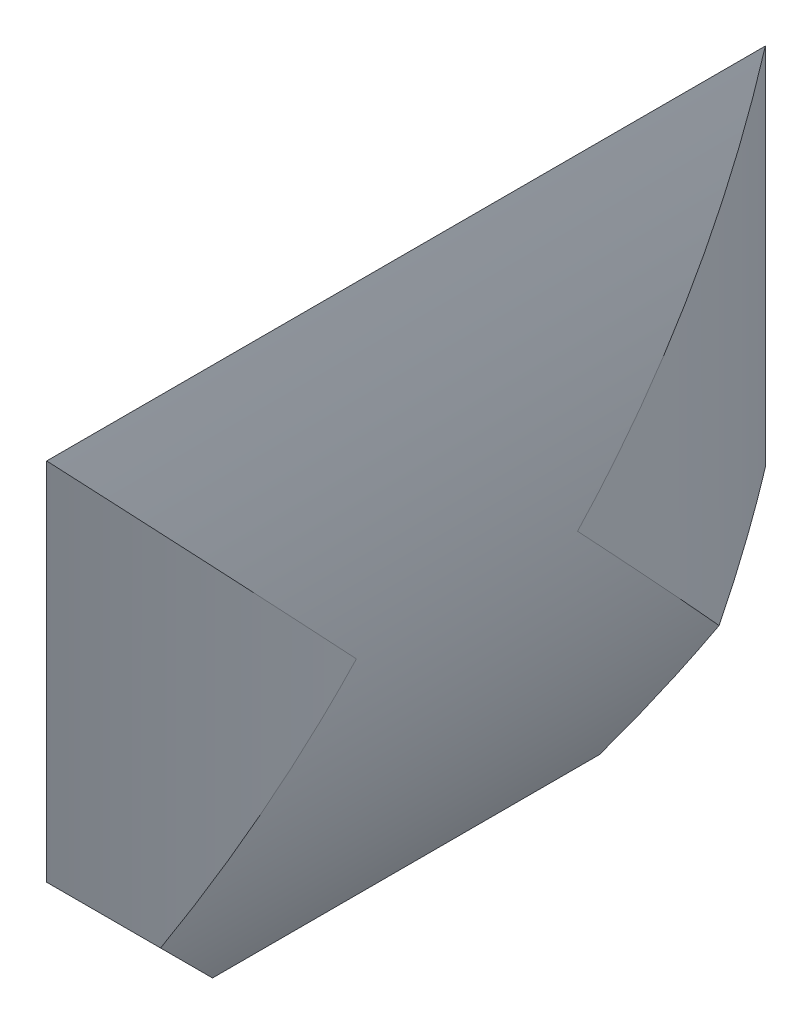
ISO-10303-21;
HEADER;
FILE_DESCRIPTION(('STEP AP214'),'2;1');
FILE_NAME('part.step','',(''),(''),'','','');
FILE_SCHEMA(('AUTOMOTIVE_DESIGN { 1 0 10303 214 1 1 1 1 }'));
ENDSEC;
DATA;
#1=APPLICATION_CONTEXT('core data for automotive mechanical design processes');
#2=APPLICATION_PROTOCOL_DEFINITION('international standard','automotive_design',2000,#1);
#3=PRODUCT_CONTEXT('',#1,'mechanical');
#4=PRODUCT('Part','Part','',(#3));
#5=PRODUCT_RELATED_PRODUCT_CATEGORY('part','',(#4));
#6=PRODUCT_DEFINITION_FORMATION('','',#4);
#7=PRODUCT_DEFINITION_CONTEXT('part definition',#1,'design');
#8=PRODUCT_DEFINITION('design','',#6,#7);
#9=PRODUCT_DEFINITION_SHAPE('','',#8);
#10=(LENGTH_UNIT() NAMED_UNIT(*) SI_UNIT(.MILLI.,.METRE.));
#11=(NAMED_UNIT(*) PLANE_ANGLE_UNIT() SI_UNIT($,.RADIAN.));
#12=(NAMED_UNIT(*) SI_UNIT($,.STERADIAN.) SOLID_ANGLE_UNIT());
#13=UNCERTAINTY_MEASURE_WITH_UNIT(LENGTH_MEASURE(1.E-05),#10,'distance_accuracy_value','');
#14=(GEOMETRIC_REPRESENTATION_CONTEXT(3) GLOBAL_UNCERTAINTY_ASSIGNED_CONTEXT((#13)) GLOBAL_UNIT_ASSIGNED_CONTEXT((#10,
#11,#12)) REPRESENTATION_CONTEXT('',''));
#15=CARTESIAN_POINT('',(0.,0.,0.));
#16=DIRECTION('',(0.,0.,1.));
#17=DIRECTION('',(1.,0.,0.));
#18=AXIS2_PLACEMENT_3D('',#15,#16,#17);
#19=CARTESIAN_POINT('',(125.697925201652,0.,165.1));
#20=DIRECTION('',(0.,0.,-1.));
#21=DIRECTION('',(-1.,0.,0.));
#22=AXIS2_PLACEMENT_3D('',#19,#20,#21);
#23=CYLINDRICAL_SURFACE('',#22,139.7);
#24=CARTESIAN_POINT('',(-6.03162003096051,-46.5125457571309,82.55));
#25=CARTESIAN_POINT('',(-6.03161716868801,-46.5125553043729,82.7726419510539));
#26=CARTESIAN_POINT('',(-6.02535251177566,-46.5303080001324,82.995444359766));
#27=CARTESIAN_POINT('',(-6.00041011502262,-46.6008564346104,83.4349040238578));
#28=CARTESIAN_POINT('',(-5.98171752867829,-46.6536940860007,83.6515536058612));
#29=CARTESIAN_POINT('',(-5.93233679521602,-46.7928364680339,84.0722717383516));
#30=CARTESIAN_POINT('',(-5.90165499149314,-46.8791235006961,84.2763468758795));
#31=CARTESIAN_POINT('',(-5.82899389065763,-47.0825994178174,84.6661928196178));
#32=CARTESIAN_POINT('',(-5.78701730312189,-47.1997808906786,84.8519680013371));
#33=CARTESIAN_POINT('',(-5.69267021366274,-47.4617823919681,85.2002489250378));
#34=CARTESIAN_POINT('',(-5.64028749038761,-47.6066349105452,85.3627269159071));
#35=CARTESIAN_POINT('',(-5.52639317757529,-47.9196822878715,85.6595772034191));
#36=CARTESIAN_POINT('',(-5.46488115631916,-48.0878782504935,85.7939481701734));
#37=CARTESIAN_POINT('',(-5.33412805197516,-48.443026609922,86.0309732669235));
#38=CARTESIAN_POINT('',(-5.26487519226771,-48.63000754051,86.1335781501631));
#39=CARTESIAN_POINT('',(-5.12047528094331,-49.0171269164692,86.3038823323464));
#40=CARTESIAN_POINT('',(-5.04532822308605,-49.2172653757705,86.3715815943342));
#41=CARTESIAN_POINT('',(-4.89109500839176,-49.6250472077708,86.4701649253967));
#42=CARTESIAN_POINT('',(-4.81200736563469,-49.8326934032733,86.5010349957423));
#43=CARTESIAN_POINT('',(-4.65209706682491,-50.2494926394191,86.5250193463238));
#44=CARTESIAN_POINT('',(-4.57127442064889,-50.4586456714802,86.5181338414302));
#45=CARTESIAN_POINT('',(-4.41026733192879,-50.8723646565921,86.4668033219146));
#46=CARTESIAN_POINT('',(-4.33008246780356,-51.0769338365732,86.4223856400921));
#47=CARTESIAN_POINT('',(-4.17267054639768,-51.4758620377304,86.2972726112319));
#48=CARTESIAN_POINT('',(-4.09544347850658,-51.6702210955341,86.2165773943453));
#49=CARTESIAN_POINT('',(-3.94637812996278,-52.0431065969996,86.0212754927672));
#50=CARTESIAN_POINT('',(-3.87453537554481,-52.2216462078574,85.9066973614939));
#51=CARTESIAN_POINT('',(-3.73843030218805,-52.5580903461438,85.646852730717));
#52=CARTESIAN_POINT('',(-3.67416796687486,-52.715994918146,85.5015862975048));
#53=CARTESIAN_POINT('',(-3.55531668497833,-53.0067371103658,85.1845386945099));
#54=CARTESIAN_POINT('',(-3.50072472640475,-53.1395825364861,85.0127658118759));
#55=CARTESIAN_POINT('',(-3.40298605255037,-53.3765978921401,84.6475475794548));
#56=CARTESIAN_POINT('',(-3.35983934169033,-53.4807678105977,84.4541022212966));
#57=CARTESIAN_POINT('',(-3.2864310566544,-53.6575721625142,84.0510160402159));
#58=CARTESIAN_POINT('',(-3.25617035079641,-53.7302044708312,83.8413741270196));
#59=CARTESIAN_POINT('',(-3.20956156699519,-53.841931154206,83.411856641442));
#60=CARTESIAN_POINT('',(-3.19321349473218,-53.8810255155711,83.1919810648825));
#61=CARTESIAN_POINT('',(-3.17498594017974,-53.9246079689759,82.7482164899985));
#62=CARTESIAN_POINT('',(-3.17310777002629,-53.9290929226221,82.5243271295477));
#63=CARTESIAN_POINT('',(-3.18388763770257,-53.9033255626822,82.0789096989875));
#64=CARTESIAN_POINT('',(-3.19654568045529,-53.8730732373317,81.8573816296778));
#65=CARTESIAN_POINT('',(-3.23596669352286,-53.7786585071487,81.4229710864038));
#66=CARTESIAN_POINT('',(-3.26272992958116,-53.7144954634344,81.2100887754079));
#67=CARTESIAN_POINT('',(-3.3294542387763,-53.5540181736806,80.7990178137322));
#68=CARTESIAN_POINT('',(-3.36941530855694,-53.4577039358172,80.6008291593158));
#69=CARTESIAN_POINT('',(-3.46119280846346,-53.2355766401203,80.2247794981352));
#70=CARTESIAN_POINT('',(-3.51300879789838,-53.1097646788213,80.0469177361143));
#71=CARTESIAN_POINT('',(-3.62678366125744,-52.832112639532,79.7165632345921));
#72=CARTESIAN_POINT('',(-3.68874252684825,-52.6802725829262,79.564070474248));
#73=CARTESIAN_POINT('',(-3.82078550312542,-52.3547930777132,79.2887971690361));
#74=CARTESIAN_POINT('',(-3.89086873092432,-52.1811559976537,79.1660134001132));
#75=CARTESIAN_POINT('',(-4.0369441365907,-51.8169096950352,78.9536173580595));
#76=CARTESIAN_POINT('',(-4.11293630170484,-51.6263005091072,78.8640050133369));
#77=CARTESIAN_POINT('',(-4.26848646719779,-51.2334503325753,78.7204844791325));
#78=CARTESIAN_POINT('',(-4.34804447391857,-51.0312093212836,78.6665763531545));
#79=CARTESIAN_POINT('',(-4.50835012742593,-50.6207900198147,78.5959778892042));
#80=CARTESIAN_POINT('',(-4.58909777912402,-50.4126117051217,78.5792877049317));
#81=CARTESIAN_POINT('',(-4.74949445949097,-49.9961051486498,78.5835809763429));
#82=CARTESIAN_POINT('',(-4.82914293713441,-49.7877768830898,78.6045826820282));
#83=CARTESIAN_POINT('',(-4.98509184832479,-49.3769920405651,78.6836827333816));
#84=CARTESIAN_POINT('',(-5.06139225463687,-49.1745355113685,78.7417813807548));
#85=CARTESIAN_POINT('',(-5.20868050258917,-48.7810904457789,78.893490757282));
#86=CARTESIAN_POINT('',(-5.27966332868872,-48.5901127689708,78.9871345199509));
#87=CARTESIAN_POINT('',(-5.41441542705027,-48.2253252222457,79.2072710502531));
#88=CARTESIAN_POINT('',(-5.47818494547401,-48.0515147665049,79.3337626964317));
#89=CARTESIAN_POINT('',(-5.59696246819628,-47.726015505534,79.6160735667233));
#90=CARTESIAN_POINT('',(-5.65196710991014,-47.5743351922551,79.7719039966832));
#91=CARTESIAN_POINT('',(-5.75188450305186,-47.2975606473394,80.1085031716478));
#92=CARTESIAN_POINT('',(-5.7967947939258,-47.1724728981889,80.2892779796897));
#93=CARTESIAN_POINT('',(-5.87544938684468,-46.952643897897,80.6705226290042));
#94=CARTESIAN_POINT('',(-5.90919724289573,-46.8578929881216,80.8709861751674));
#95=CARTESIAN_POINT('',(-5.96475034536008,-46.7015718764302,81.2858179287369));
#96=CARTESIAN_POINT('',(-5.98656998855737,-46.6399616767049,81.5001690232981));
#97=CARTESIAN_POINT('',(-6.01198146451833,-46.5681359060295,81.8549066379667));
#98=CARTESIAN_POINT('',(-6.01933836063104,-46.5473167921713,81.9929775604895));
#99=CARTESIAN_POINT('',(-6.02915853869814,-46.519518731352,82.2706779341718));
#100=CARTESIAN_POINT('',(-6.031621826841,-46.5125397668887,82.4103073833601));
#101=CARTESIAN_POINT('',(-6.03162003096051,-46.5125457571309,82.55));
#102=B_SPLINE_CURVE_WITH_KNOTS('',3,(#24,#25,#26,#27,#28,#29,#30,#31,#32,#33,#34,#35,#36,#37,
#38,#39,#40,#41,#42,#43,#44,#45,#46,#47,#48,#49,#50,#51,#52,#53,#54,#55,#56,#57,#58,#59,#60,#61,
#62,#63,#64,#65,#66,#67,#68,#69,#70,#71,#72,#73,#74,#75,#76,#77,#78,#79,#80,#81,#82,#83,#84,#85,
#86,#87,#88,#89,#90,#91,#92,#93,#94,#95,#96,#97,#98,#99,#100,#101),.UNSPECIFIED.,.T.,.F.,(4,2,2,
2,2,2,2,2,2,2,2,2,2,2,2,2,2,2,2,2,2,2,2,2,2,2,2,2,2,2,2,2,2,2,2,2,2,2,4),(0.,0.667415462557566,
1.33562966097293,2.00349079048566,2.67119184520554,3.33968175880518,4.00820329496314,
4.67775610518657,5.34730962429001,6.01711755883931,6.68692168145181,7.35623843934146,
8.0255527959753,8.69430471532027,9.3630551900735,10.0315970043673,10.7001390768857,
11.3687261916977,12.0373135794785,12.7059615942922,13.3746098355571,14.0432706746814,
14.7119313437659,15.3805671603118,16.0492024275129,16.7177651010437,17.3863263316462,
18.0548887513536,18.7234539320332,19.3923429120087,20.061237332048,20.7307549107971,
21.4002496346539,22.0700005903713,22.7399146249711,23.4096151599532,24.0785056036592,
24.4972637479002,24.9160213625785),.UNSPECIFIED.);
#103=CARTESIAN_POINT('',(-6.03162003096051,-46.5125457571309,82.55));
#104=VERTEX_POINT('',#103);
#105=EDGE_CURVE('E31',#104,#104,#102,.T.);
#106=ORIENTED_EDGE('',*,*,#105,.T.);
#107=EDGE_LOOP('',(#106));
#108=FACE_BOUND('',#107,.T.);
#109=CARTESIAN_POINT('',(0.,-60.96,165.1));
#110=CARTESIAN_POINT('',(-0.597068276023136,-59.7288420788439,163.954645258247));
#111=CARTESIAN_POINT('',(-1.17410469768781,-58.4929576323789,162.803966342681));
#112=CARTESIAN_POINT('',(-2.28854040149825,-56.0125324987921,160.492849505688));
#113=CARTESIAN_POINT('',(-2.82594066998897,-54.7679920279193,159.332411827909));
#114=CARTESIAN_POINT('',(-3.8614916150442,-52.2711559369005,157.002764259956));
#115=CARTESIAN_POINT('',(-4.35964748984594,-51.0188613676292,155.833555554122));
#116=CARTESIAN_POINT('',(-5.3171832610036,-48.5070908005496,153.487038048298));
#117=CARTESIAN_POINT('',(-5.77656289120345,-47.2476147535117,152.309729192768));
#118=CARTESIAN_POINT('',(-7.09726126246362,-43.4589938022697,148.76638964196));
#119=CARTESIAN_POINT('',(-7.90101600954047,-40.9199545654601,146.389224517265));
#120=CARTESIAN_POINT('',(-9.35753689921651,-35.8209835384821,141.611309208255));
#121=CARTESIAN_POINT('',(-10.0102990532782,-33.2610511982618,139.210558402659));
#122=CARTESIAN_POINT('',(-11.1591770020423,-28.1596626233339,134.423296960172));
#123=CARTESIAN_POINT('',(-11.6572922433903,-25.6184248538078,132.03703296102));
#124=CARTESIAN_POINT('',(-12.5103051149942,-20.5242479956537,127.251304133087));
#125=CARTESIAN_POINT('',(-12.8651983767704,-17.9713085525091,124.851838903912));
#126=CARTESIAN_POINT('',(-13.4327139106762,-12.8594255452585,120.045815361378));
#127=CARTESIAN_POINT('',(-13.6454246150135,-10.3004867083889,117.639262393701));
#128=CARTESIAN_POINT('',(-13.9295886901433,-5.17908699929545,112.822125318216));
#129=CARTESIAN_POINT('',(-14.0010656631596,-2.61662678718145,110.411541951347));
#130=CARTESIAN_POINT('',(-14.0020712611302,-0.0362981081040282,107.984146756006));
#131=CARTESIAN_POINT('',(-14.0020747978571,-0.0181490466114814,107.967073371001));
#132=CARTESIAN_POINT('',(-14.0020747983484,0.,107.95));
#133=B_SPLINE_CURVE_WITH_KNOTS('',3,(#109,#110,#111,#112,#113,#114,#115,#116,#117,#118,#119,
#120,#121,#122,#123,#124,#125,#126,#127,#128,#129,#130,#131,#132),.UNSPECIFIED.,.F.,.F.,(4,2,2,
2,2,2,2,2,2,2,2,4),(0.,5.35303115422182,10.7059290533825,16.0581167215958,21.4103411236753,
32.1160683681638,42.8220783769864,53.3832733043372,63.944790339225,74.4997323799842,
85.0529103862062,85.1276633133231),.UNSPECIFIED.);
#134=CARTESIAN_POINT('',(-14.0020747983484,0.,107.95));
#135=VERTEX_POINT('',#134);
#136=CARTESIAN_POINT('',(-7.77117038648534,-41.2563997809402,146.70360021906));
#137=VERTEX_POINT('',#136);
#138=EDGE_CURVE('E46',#135,#137,#133,.F.);
#139=ORIENTED_EDGE('',*,*,#138,.F.);
#140=CARTESIAN_POINT('',(0.,60.96,165.1));
#141=CARTESIAN_POINT('',(-0.59706827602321,59.7288420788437,163.954645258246));
#142=CARTESIAN_POINT('',(-1.17410469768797,58.4929576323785,162.803966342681));
#143=CARTESIAN_POINT('',(-2.28854040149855,56.0125324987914,160.492849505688));
#144=CARTESIAN_POINT('',(-2.82594066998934,54.7679920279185,159.332411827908));
#145=CARTESIAN_POINT('',(-3.86149161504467,52.2711559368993,157.002764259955));
#146=CARTESIAN_POINT('',(-4.35964748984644,51.018861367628,155.833555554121));
#147=CARTESIAN_POINT('',(-5.31718326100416,48.5070908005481,153.487038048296));
#148=CARTESIAN_POINT('',(-5.77656289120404,47.2476147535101,152.309729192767));
#149=CARTESIAN_POINT('',(-7.09726126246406,43.4589938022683,148.766389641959));
#150=CARTESIAN_POINT('',(-7.90101600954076,40.9199545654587,146.389224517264));
#151=CARTESIAN_POINT('',(-9.35753689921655,35.8209835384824,141.611309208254));
#152=CARTESIAN_POINT('',(-10.0102990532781,33.2610511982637,139.210558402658));
#153=CARTESIAN_POINT('',(-11.1591770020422,28.1596626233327,134.423296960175));
#154=CARTESIAN_POINT('',(-11.6572922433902,25.6184248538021,132.037032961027));
#155=CARTESIAN_POINT('',(-12.5103051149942,20.5242479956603,127.251304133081));
#156=CARTESIAN_POINT('',(-12.8651983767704,17.9713085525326,124.851838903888));
#157=CARTESIAN_POINT('',(-13.4327139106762,12.8594255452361,120.045815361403));
#158=CARTESIAN_POINT('',(-13.6454246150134,10.3004867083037,117.639262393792));
#159=CARTESIAN_POINT('',(-13.9295886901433,5.1790869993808,112.822125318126));
#160=CARTESIAN_POINT('',(-14.0010656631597,2.61662678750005,110.411541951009));
#161=CARTESIAN_POINT('',(-14.0020712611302,0.0362981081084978,107.984146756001));
#162=CARTESIAN_POINT('',(-14.0020747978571,0.01814904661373,107.967073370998));
#163=CARTESIAN_POINT('',(-14.0020747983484,0.,107.95));
#164=B_SPLINE_CURVE_WITH_KNOTS('',3,(#140,#141,#142,#143,#144,#145,#146,#147,#148,#149,#150,
#151,#152,#153,#154,#155,#156,#157,#158,#159,#160,#161,#162,#163),.UNSPECIFIED.,.F.,.F.,(4,2,2,
2,2,2,2,2,2,2,2,4),(0.,5.35303115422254,10.7059290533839,16.0581167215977,21.4103411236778,
32.1160683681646,42.8220783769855,53.3832733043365,63.9447903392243,74.4997323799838,
85.0529103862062,85.1276633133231),.UNSPECIFIED.);
#165=CARTESIAN_POINT('',(0.,60.96,165.1));
#166=VERTEX_POINT('',#165);
#167=EDGE_CURVE('E113',#166,#135,#164,.T.);
#168=ORIENTED_EDGE('',*,*,#167,.F.);
#169=DIRECTION('',(0.,0.,-1.));
#170=VECTOR('',#169,1.);
#171=CARTESIAN_POINT('',(0.,60.96,165.1));
#172=LINE('',#171,#170);
#173=CARTESIAN_POINT('',(0.,60.96,0.));
#174=VERTEX_POINT('',#173);
#175=EDGE_CURVE('E109',#166,#174,#172,.T.);
#176=ORIENTED_EDGE('',*,*,#175,.T.);
#177=CARTESIAN_POINT('',(0.,60.9599999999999,0.));
#178=CARTESIAN_POINT('',(-0.597068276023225,59.7288420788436,1.14535474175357));
#179=CARTESIAN_POINT('',(-1.17410469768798,58.4929576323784,2.29603365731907));
#180=CARTESIAN_POINT('',(-2.28854040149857,56.0125324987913,4.60715049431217));
#181=CARTESIAN_POINT('',(-2.82594066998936,54.7679920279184,5.76758817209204));
#182=CARTESIAN_POINT('',(-3.86149161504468,52.2711559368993,8.09723574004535));
#183=CARTESIAN_POINT('',(-4.35964748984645,51.0188613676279,9.26644444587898));
#184=CARTESIAN_POINT('',(-5.31718326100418,48.507090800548,11.6129619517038));
#185=CARTESIAN_POINT('',(-5.77656289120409,47.24761475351,12.7902708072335));
#186=CARTESIAN_POINT('',(-7.09726126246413,43.4589938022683,16.3336103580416));
#187=CARTESIAN_POINT('',(-7.90101600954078,40.9199545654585,18.7107754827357));
#188=CARTESIAN_POINT('',(-9.35753689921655,35.8209835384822,23.4886907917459));
#189=CARTESIAN_POINT('',(-10.0102990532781,33.2610511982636,25.8894415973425));
#190=CARTESIAN_POINT('',(-11.1591770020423,28.1596626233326,30.6767030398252));
#191=CARTESIAN_POINT('',(-11.6572922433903,25.6184248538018,33.0629670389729));
#192=CARTESIAN_POINT('',(-12.5103051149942,20.5242479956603,37.8486958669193));
#193=CARTESIAN_POINT('',(-12.8651983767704,17.9713085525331,40.2481610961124));
#194=CARTESIAN_POINT('',(-13.4327139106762,12.8594255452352,45.054184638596));
#195=CARTESIAN_POINT('',(-13.6454246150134,10.3004867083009,47.4607376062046));
#196=CARTESIAN_POINT('',(-13.9295886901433,5.17908699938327,52.2778746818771));
#197=CARTESIAN_POINT('',(-14.0010656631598,2.61662678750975,54.6884580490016));
#198=CARTESIAN_POINT('',(-14.0020712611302,0.0362981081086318,57.1158532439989));
#199=CARTESIAN_POINT('',(-14.0020747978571,0.0181490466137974,57.1329266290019));
#200=CARTESIAN_POINT('',(-14.0020747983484,0.,57.15));
#201=B_SPLINE_CURVE_WITH_KNOTS('',3,(#177,#178,#179,#180,#181,#182,#183,#184,#185,#186,#187,
#188,#189,#190,#191,#192,#193,#194,#195,#196,#197,#198,#199,#200),.UNSPECIFIED.,.F.,.F.,(4,2,2,
2,2,2,2,2,2,2,2,4),(0.,5.35303115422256,10.705929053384,16.0581167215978,21.4103411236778,
32.1160683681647,42.8220783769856,53.3832733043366,63.9447903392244,74.4997323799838,
85.0529103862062,85.1276633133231),.UNSPECIFIED.);
#202=CARTESIAN_POINT('',(-14.0020747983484,0.,57.15));
#203=VERTEX_POINT('',#202);
#204=EDGE_CURVE('E87',#203,#174,#201,.F.);
#205=ORIENTED_EDGE('',*,*,#204,.F.);
#206=CARTESIAN_POINT('',(0.,-60.96,0.));
#207=CARTESIAN_POINT('',(-0.597068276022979,-59.7288420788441,1.1453547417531));
#208=CARTESIAN_POINT('',(-1.17410469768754,-58.4929576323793,2.29603365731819));
#209=CARTESIAN_POINT('',(-2.28854040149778,-56.0125324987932,4.6071504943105));
#210=CARTESIAN_POINT('',(-2.82594066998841,-54.7679920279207,5.76758817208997));
#211=CARTESIAN_POINT('',(-3.86149161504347,-52.2711559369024,8.09723574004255));
#212=CARTESIAN_POINT('',(-4.35964748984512,-51.0188613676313,9.26644444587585));
#213=CARTESIAN_POINT('',(-5.31718326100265,-48.5070908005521,11.6129619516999));
#214=CARTESIAN_POINT('',(-5.77656289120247,-47.2476147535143,12.7902708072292));
#215=CARTESIAN_POINT('',(-7.0972612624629,-43.4589938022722,16.3336103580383));
#216=CARTESIAN_POINT('',(-7.90101600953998,-40.9199545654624,18.7107754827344));
#217=CARTESIAN_POINT('',(-9.35753689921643,-35.8209835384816,23.4886907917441));
#218=CARTESIAN_POINT('',(-10.0102990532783,-33.2610511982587,25.8894415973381));
#219=CARTESIAN_POINT('',(-11.1591770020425,-28.1596626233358,30.6767030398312));
#220=CARTESIAN_POINT('',(-11.6572922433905,-25.6184248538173,33.0629670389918));
#221=CARTESIAN_POINT('',(-12.5103051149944,-20.5242479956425,37.8486958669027));
#222=CARTESIAN_POINT('',(-12.8651983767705,-17.9713085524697,40.2481610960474));
#223=CARTESIAN_POINT('',(-13.4327139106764,-12.8594255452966,45.0541846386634));
#224=CARTESIAN_POINT('',(-13.6454246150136,-10.3004867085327,47.4607376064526));
#225=CARTESIAN_POINT('',(-13.9295886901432,-5.17908699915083,52.2778746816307));
#226=CARTESIAN_POINT('',(-14.0010656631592,-2.61662678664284,54.6884580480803));
#227=CARTESIAN_POINT('',(-14.0020712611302,-0.0362981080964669,57.1158532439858));
#228=CARTESIAN_POINT('',(-14.0020747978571,-0.0181490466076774,57.1329266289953));
#229=CARTESIAN_POINT('',(-14.0020747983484,0.,57.15));
#230=B_SPLINE_CURVE_WITH_KNOTS('',3,(#206,#207,#208,#209,#210,#211,#212,#213,#214,#215,#216,
#217,#218,#219,#220,#221,#222,#223,#224,#225,#226,#227,#228,#229),.UNSPECIFIED.,.F.,.F.,(4,2,2,
2,2,2,2,2,2,2,2,4),(0.,5.35303115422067,10.7059290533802,16.0581167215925,21.4103411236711,
32.1160683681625,42.8220783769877,53.3832733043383,63.9447903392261,74.4997323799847,
85.0529103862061,85.1276633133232),.UNSPECIFIED.);
#231=CARTESIAN_POINT('',(-7.77117038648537,-41.2563997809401,18.3963997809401));
#232=VERTEX_POINT('',#231);
#233=EDGE_CURVE('E90',#232,#203,#230,.T.);
#234=ORIENTED_EDGE('',*,*,#233,.F.);
#235=CARTESIAN_POINT('',(125.697925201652,0.,-22.86));
#236=DIRECTION('',(0.,0.707106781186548,0.707106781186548));
#237=DIRECTION('',(0.,0.707106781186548,-0.707106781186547));
#238=AXIS2_PLACEMENT_3D('',#235,#236,#237);
#239=ELLIPSE('',#238,197.565634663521,139.7);
#240=CARTESIAN_POINT('',(0.,-60.96,38.1));
#241=VERTEX_POINT('',#240);
#242=EDGE_CURVE('E141',#232,#241,#239,.T.);
#243=ORIENTED_EDGE('',*,*,#242,.T.);
#244=DIRECTION('',(0.,0.,-1.));
#245=VECTOR('',#244,1.);
#246=CARTESIAN_POINT('',(0.,-60.96,165.1));
#247=LINE('',#246,#245);
#248=CARTESIAN_POINT('',(0.,-60.96,127.));
#249=VERTEX_POINT('',#248);
#250=EDGE_CURVE('E114',#249,#241,#247,.T.);
#251=ORIENTED_EDGE('',*,*,#250,.F.);
#252=CARTESIAN_POINT('',(125.697925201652,0.,187.96));
#253=DIRECTION('',(0.,0.707106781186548,-0.707106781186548));
#254=DIRECTION('',(0.,-0.707106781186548,-0.707106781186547));
#255=AXIS2_PLACEMENT_3D('',#252,#253,#254);
#256=ELLIPSE('',#255,197.565634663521,139.7);
#257=EDGE_CURVE('E115',#249,#137,#256,.T.);
#258=ORIENTED_EDGE('',*,*,#257,.T.);
#259=EDGE_LOOP('',(#139,#168,#176,#205,#234,#243,#251,#258));
#260=FACE_BOUND('',#259,.T.);
#261=ADVANCED_FACE('F27',(#108,#260),#23,.T.);
#262=CARTESIAN_POINT('',(-125.697925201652,0.,165.1));
#263=DIRECTION('',(0.,0.,-1.));
#264=DIRECTION('',(-1.,0.,0.));
#265=AXIS2_PLACEMENT_3D('',#262,#263,#264);
#266=CYLINDRICAL_SURFACE('',#265,139.7);
#267=CARTESIAN_POINT('',(0.,-60.9599999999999,0.));
#268=CARTESIAN_POINT('',(0.597068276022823,-59.7288420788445,1.14535474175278));
#269=CARTESIAN_POINT('',(1.17410469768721,-58.4929576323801,2.29603365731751));
#270=CARTESIAN_POINT('',(2.2885404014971,-56.0125324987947,4.60715049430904));
#271=CARTESIAN_POINT('',(2.82594066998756,-54.7679920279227,5.76758817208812));
#272=CARTESIAN_POINT('',(3.86149161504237,-52.271155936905,8.09723574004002));
#273=CARTESIAN_POINT('',(4.35964748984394,-51.0188613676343,9.26644444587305));
#274=CARTESIAN_POINT('',(5.31718326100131,-48.5070908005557,11.6129619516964));
#275=CARTESIAN_POINT('',(5.77656289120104,-47.2476147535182,12.7902708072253));
#276=CARTESIAN_POINT('',(7.09726126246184,-43.4589938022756,16.3336103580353));
#277=CARTESIAN_POINT('',(7.90101600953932,-40.9199545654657,18.7107754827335));
#278=CARTESIAN_POINT('',(9.35753689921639,-35.8209835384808,23.4886907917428));
#279=CARTESIAN_POINT('',(10.0102990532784,-33.2610511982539,25.8894415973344));
#280=CARTESIAN_POINT('',(11.1591770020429,-28.1596626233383,30.676703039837));
#281=CARTESIAN_POINT('',(11.6572922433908,-25.6184248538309,33.0629670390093));
#282=CARTESIAN_POINT('',(12.5103051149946,-20.524247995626,37.8486958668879));
#283=CARTESIAN_POINT('',(12.8651983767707,-17.9713085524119,40.2481610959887));
#284=CARTESIAN_POINT('',(13.4327139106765,-12.8594255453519,45.0541846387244));
#285=CARTESIAN_POINT('',(13.6454246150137,-10.3004867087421,47.4607376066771));
#286=CARTESIAN_POINT('',(13.9295886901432,-5.17908699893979,52.2778746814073));
#287=CARTESIAN_POINT('',(14.001065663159,-2.6166267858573,54.6884580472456));
#288=CARTESIAN_POINT('',(14.0020712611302,-0.0362981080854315,57.115853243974));
#289=CARTESIAN_POINT('',(14.0020747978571,-0.0181490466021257,57.1329266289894));
#290=CARTESIAN_POINT('',(14.0020747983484,0.,57.15));
#291=B_SPLINE_CURVE_WITH_KNOTS('',3,(#267,#268,#269,#270,#271,#272,#273,#274,#275,#276,#277,
#278,#279,#280,#281,#282,#283,#284,#285,#286,#287,#288,#289,#290),.UNSPECIFIED.,.F.,.F.,(4,2,2,
2,2,2,2,2,2,2,2,4),(0.,5.35303115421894,10.7059290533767,16.0581167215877,21.410341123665,
32.1160683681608,42.8220783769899,53.3832733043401,63.9447903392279,74.4997323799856,
85.0529103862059,85.1276633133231),.UNSPECIFIED.);
#292=CARTESIAN_POINT('',(14.0020747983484,0.,57.15));
#293=VERTEX_POINT('',#292);
#294=CARTESIAN_POINT('',(7.77117038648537,-41.25639978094,18.39639978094));
#295=VERTEX_POINT('',#294);
#296=EDGE_CURVE('E93',#293,#295,#291,.F.);
#297=ORIENTED_EDGE('',*,*,#296,.F.);
#298=CARTESIAN_POINT('',(0.,60.9599999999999,0.));
#299=CARTESIAN_POINT('',(0.597068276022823,59.7288420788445,1.14535474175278));
#300=CARTESIAN_POINT('',(1.17410469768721,58.4929576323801,2.29603365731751));
#301=CARTESIAN_POINT('',(2.2885404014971,56.0125324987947,4.60715049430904));
#302=CARTESIAN_POINT('',(2.82594066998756,54.7679920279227,5.76758817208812));
#303=CARTESIAN_POINT('',(3.86149161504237,52.271155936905,8.09723574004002));
#304=CARTESIAN_POINT('',(4.35964748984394,51.0188613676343,9.26644444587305));
#305=CARTESIAN_POINT('',(5.31718326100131,48.5070908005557,11.6129619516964));
#306=CARTESIAN_POINT('',(5.77656289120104,47.2476147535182,12.7902708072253));
#307=CARTESIAN_POINT('',(7.09726126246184,43.4589938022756,16.3336103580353));
#308=CARTESIAN_POINT('',(7.90101600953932,40.9199545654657,18.7107754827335));
#309=CARTESIAN_POINT('',(9.35753689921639,35.8209835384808,23.4886907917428));
#310=CARTESIAN_POINT('',(10.0102990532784,33.2610511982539,25.8894415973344));
#311=CARTESIAN_POINT('',(11.1591770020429,28.1596626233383,30.676703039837));
#312=CARTESIAN_POINT('',(11.6572922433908,25.6184248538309,33.0629670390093));
#313=CARTESIAN_POINT('',(12.5103051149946,20.524247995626,37.8486958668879));
#314=CARTESIAN_POINT('',(12.8651983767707,17.9713085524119,40.2481610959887));
#315=CARTESIAN_POINT('',(13.4327139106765,12.8594255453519,45.0541846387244));
#316=CARTESIAN_POINT('',(13.6454246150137,10.3004867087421,47.4607376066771));
#317=CARTESIAN_POINT('',(13.9295886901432,5.17908699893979,52.2778746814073));
#318=CARTESIAN_POINT('',(14.001065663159,2.6166267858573,54.6884580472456));
#319=CARTESIAN_POINT('',(14.0020712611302,0.0362981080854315,57.115853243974));
#320=CARTESIAN_POINT('',(14.0020747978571,0.0181490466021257,57.1329266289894));
#321=CARTESIAN_POINT('',(14.0020747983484,0.,57.15));
#322=B_SPLINE_CURVE_WITH_KNOTS('',3,(#298,#299,#300,#301,#302,#303,#304,#305,#306,#307,#308,
#309,#310,#311,#312,#313,#314,#315,#316,#317,#318,#319,#320,#321),.UNSPECIFIED.,.F.,.F.,(4,2,2,
2,2,2,2,2,2,2,2,4),(0.,5.35303115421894,10.7059290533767,16.0581167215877,21.410341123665,
32.1160683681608,42.8220783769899,53.3832733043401,63.9447903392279,74.4997323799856,
85.0529103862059,85.1276633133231),.UNSPECIFIED.);
#323=EDGE_CURVE('E98',#174,#293,#322,.T.);
#324=ORIENTED_EDGE('',*,*,#323,.F.);
#325=ORIENTED_EDGE('',*,*,#175,.F.);
#326=CARTESIAN_POINT('',(0.,60.96,165.1));
#327=CARTESIAN_POINT('',(0.597068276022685,59.7288420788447,163.954645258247));
#328=CARTESIAN_POINT('',(1.17410469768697,58.4929576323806,162.803966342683));
#329=CARTESIAN_POINT('',(2.28854040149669,56.0125324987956,160.492849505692));
#330=CARTESIAN_POINT('',(2.82594066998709,54.7679920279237,159.332411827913));
#331=CARTESIAN_POINT('',(3.86149161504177,52.2711559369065,157.002764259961));
#332=CARTESIAN_POINT('',(4.35964748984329,51.018861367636,155.833555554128));
#333=CARTESIAN_POINT('',(5.31718326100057,48.5070908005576,153.487038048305));
#334=CARTESIAN_POINT('',(5.77656289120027,47.2476147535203,152.309729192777));
#335=CARTESIAN_POINT('',(7.0972612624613,43.4589938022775,148.766389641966));
#336=CARTESIAN_POINT('',(7.90101600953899,40.9199545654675,146.389224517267));
#337=CARTESIAN_POINT('',(9.35753689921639,35.8209835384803,141.611309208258));
#338=CARTESIAN_POINT('',(10.0102990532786,33.2610511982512,139.210558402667));
#339=CARTESIAN_POINT('',(11.159177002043,28.1596626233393,134.42329696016));
#340=CARTESIAN_POINT('',(11.6572922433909,25.6184248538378,132.037032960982));
#341=CARTESIAN_POINT('',(12.5103051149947,20.5242479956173,127.25130413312));
#342=CARTESIAN_POINT('',(12.8651983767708,17.9713085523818,124.851838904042));
#343=CARTESIAN_POINT('',(13.4327139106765,12.8594255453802,120.045815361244));
#344=CARTESIAN_POINT('',(13.6454246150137,10.3004867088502,117.639262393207));
#345=CARTESIAN_POINT('',(13.9295886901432,5.17908699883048,112.822125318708));
#346=CARTESIAN_POINT('',(14.0010656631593,2.61662678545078,110.411541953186));
#347=CARTESIAN_POINT('',(14.0020712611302,0.0362981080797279,107.984146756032));
#348=CARTESIAN_POINT('',(14.0020747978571,0.0181490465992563,107.967073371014));
#349=CARTESIAN_POINT('',(14.0020747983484,0.,107.95));
#350=B_SPLINE_CURVE_WITH_KNOTS('',3,(#326,#327,#328,#329,#330,#331,#332,#333,#334,#335,#336,
#337,#338,#339,#340,#341,#342,#343,#344,#345,#346,#347,#348,#349),.UNSPECIFIED.,.F.,.F.,(4,2,2,
2,2,2,2,2,2,2,2,4),(0.,5.35303115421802,10.7059290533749,16.0581167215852,21.4103411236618,
32.11606836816,42.8220783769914,53.3832733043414,63.9447903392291,74.4997323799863,
85.0529103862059,85.1276633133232),.UNSPECIFIED.);
#351=CARTESIAN_POINT('',(14.0020747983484,0.,107.95));
#352=VERTEX_POINT('',#351);
#353=EDGE_CURVE('E136',#352,#166,#350,.F.);
#354=ORIENTED_EDGE('',*,*,#353,.F.);
#355=CARTESIAN_POINT('',(0.,-60.96,165.1));
#356=CARTESIAN_POINT('',(0.597068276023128,-59.7288420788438,163.954645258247));
#357=CARTESIAN_POINT('',(1.17410469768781,-58.4929576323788,162.803966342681));
#358=CARTESIAN_POINT('',(2.28854040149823,-56.0125324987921,160.492849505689));
#359=CARTESIAN_POINT('',(2.82594066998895,-54.7679920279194,159.332411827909));
#360=CARTESIAN_POINT('',(3.86149161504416,-52.2711559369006,157.002764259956));
#361=CARTESIAN_POINT('',(4.3596474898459,-51.0188613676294,155.833555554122));
#362=CARTESIAN_POINT('',(5.31718326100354,-48.5070908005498,153.487038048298));
#363=CARTESIAN_POINT('',(5.77656289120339,-47.2476147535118,152.309729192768));
#364=CARTESIAN_POINT('',(7.09726126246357,-43.4589938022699,148.76638964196));
#365=CARTESIAN_POINT('',(7.90101600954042,-40.9199545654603,146.389224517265));
#366=CARTESIAN_POINT('',(9.35753689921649,-35.8209835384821,141.611309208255));
#367=CARTESIAN_POINT('',(10.0102990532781,-33.2610511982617,139.21055840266));
#368=CARTESIAN_POINT('',(11.1591770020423,-28.1596626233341,134.423296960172));
#369=CARTESIAN_POINT('',(11.6572922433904,-25.6184248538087,132.037032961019));
#370=CARTESIAN_POINT('',(12.5103051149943,-20.5242479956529,127.251304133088));
#371=CARTESIAN_POINT('',(12.8651983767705,-17.9713085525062,124.851838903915));
#372=CARTESIAN_POINT('',(13.4327139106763,-12.8594255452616,120.045815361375));
#373=CARTESIAN_POINT('',(13.6454246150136,-10.3004867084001,117.639262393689));
#374=CARTESIAN_POINT('',(13.9295886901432,-5.17908699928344,112.822125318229));
#375=CARTESIAN_POINT('',(14.0010656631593,-2.61662678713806,110.411541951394));
#376=CARTESIAN_POINT('',(14.0020712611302,-0.0362981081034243,107.984146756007));
#377=CARTESIAN_POINT('',(14.0020747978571,-0.0181490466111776,107.967073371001));
#378=CARTESIAN_POINT('',(14.0020747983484,0.,107.95));
#379=B_SPLINE_CURVE_WITH_KNOTS('',3,(#355,#356,#357,#358,#359,#360,#361,#362,#363,#364,#365,
#366,#367,#368,#369,#370,#371,#372,#373,#374,#375,#376,#377,#378),.UNSPECIFIED.,.F.,.F.,(4,2,2,
2,2,2,2,2,2,2,2,4),(0.,5.35303115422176,10.7059290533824,16.0581167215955,21.410341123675,
32.1160683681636,42.8220783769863,53.3832733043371,63.944790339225,74.4997323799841,
85.0529103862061,85.1276633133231),.UNSPECIFIED.);
#380=CARTESIAN_POINT('',(7.77117038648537,-41.2563997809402,146.70360021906));
#381=VERTEX_POINT('',#380);
#382=EDGE_CURVE('E151',#381,#352,#379,.T.);
#383=ORIENTED_EDGE('',*,*,#382,.F.);
#384=CARTESIAN_POINT('',(-125.697925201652,0.,187.96));
#385=DIRECTION('',(0.,0.707106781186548,-0.707106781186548));
#386=DIRECTION('',(0.,-0.707106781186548,-0.707106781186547));
#387=AXIS2_PLACEMENT_3D('',#384,#385,#386);
#388=ELLIPSE('',#387,197.565634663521,139.7);
#389=EDGE_CURVE('E121',#381,#249,#388,.T.);
#390=ORIENTED_EDGE('',*,*,#389,.T.);
#391=ORIENTED_EDGE('',*,*,#250,.T.);
#392=CARTESIAN_POINT('',(-125.697925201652,0.,-22.86));
#393=DIRECTION('',(0.,0.707106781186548,0.707106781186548));
#394=DIRECTION('',(0.,0.707106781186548,-0.707106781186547));
#395=AXIS2_PLACEMENT_3D('',#392,#393,#394);
#396=ELLIPSE('',#395,197.565634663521,139.7);
#397=EDGE_CURVE('E142',#241,#295,#396,.T.);
#398=ORIENTED_EDGE('',*,*,#397,.T.);
#399=EDGE_LOOP('',(#297,#324,#325,#354,#383,#390,#391,#398));
#400=FACE_BOUND('',#399,.T.);
#401=ADVANCED_FACE('F107',(#400),#266,.T.);
#402=CARTESIAN_POINT('',(-25.4,-60.96,127.));
#403=DIRECTION('',(0.,0.707106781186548,-0.707106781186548));
#404=DIRECTION('',(0.,0.707106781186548,0.707106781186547));
#405=AXIS2_PLACEMENT_3D('',#402,#403,#404);
#406=PLANE('',#405);
#407=CARTESIAN_POINT('',(-109.628910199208,-80.01,107.95));
#408=DIRECTION('',(0.,0.707106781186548,-0.707106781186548));
#409=DIRECTION('',(0.,0.707106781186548,0.707106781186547));
#410=AXIS2_PLACEMENT_3D('',#407,#408,#409);
#411=ELLIPSE('',#410,174.840615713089,123.630984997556);
#412=CARTESIAN_POINT('',(0.,-22.86,165.1));
#413=VERTEX_POINT('',#412);
#414=EDGE_CURVE('E12',#413,#381,#411,.T.);
#415=ORIENTED_EDGE('',*,*,#414,.F.);
#416=CARTESIAN_POINT('',(109.628910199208,-80.0100000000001,107.95));
#417=DIRECTION('',(0.,0.707106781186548,-0.707106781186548));
#418=DIRECTION('',(0.,0.707106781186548,0.707106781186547));
#419=AXIS2_PLACEMENT_3D('',#416,#417,#418);
#420=ELLIPSE('',#419,174.840615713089,123.630984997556);
#421=EDGE_CURVE('E39',#137,#413,#420,.T.);
#422=ORIENTED_EDGE('',*,*,#421,.F.);
#423=ORIENTED_EDGE('',*,*,#257,.F.);
#424=ORIENTED_EDGE('',*,*,#389,.F.);
#425=EDGE_LOOP('',(#415,#422,#423,#424));
#426=FACE_BOUND('',#425,.T.);
#427=ADVANCED_FACE('F139',(#426),#406,.F.);
#428=CARTESIAN_POINT('',(-25.4,-60.96,38.1));
#429=DIRECTION('',(0.,0.707106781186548,0.707106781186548));
#430=DIRECTION('',(0.,-0.707106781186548,0.707106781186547));
#431=AXIS2_PLACEMENT_3D('',#428,#429,#430);
#432=PLANE('',#431);
#433=CARTESIAN_POINT('',(-109.628910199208,-80.0100000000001,57.15));
#434=DIRECTION('',(0.,0.707106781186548,0.707106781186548));
#435=DIRECTION('',(0.,0.707106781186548,-0.707106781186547));
#436=AXIS2_PLACEMENT_3D('',#433,#434,#435);
#437=ELLIPSE('',#436,174.840615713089,123.630984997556);
#438=CARTESIAN_POINT('',(0.,-22.86,0.));
#439=VERTEX_POINT('',#438);
#440=EDGE_CURVE('E101',#295,#439,#437,.T.);
#441=ORIENTED_EDGE('',*,*,#440,.F.);
#442=ORIENTED_EDGE('',*,*,#397,.F.);
#443=ORIENTED_EDGE('',*,*,#242,.F.);
#444=CARTESIAN_POINT('',(109.628910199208,-80.01,57.15));
#445=DIRECTION('',(0.,0.707106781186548,0.707106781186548));
#446=DIRECTION('',(0.,0.707106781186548,-0.707106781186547));
#447=AXIS2_PLACEMENT_3D('',#444,#445,#446);
#448=ELLIPSE('',#447,174.840615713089,123.630984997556);
#449=EDGE_CURVE('E118',#439,#232,#448,.T.);
#450=ORIENTED_EDGE('',*,*,#449,.F.);
#451=EDGE_LOOP('',(#441,#442,#443,#450));
#452=FACE_BOUND('',#451,.T.);
#453=ADVANCED_FACE('F181',(#452),#432,.F.);
#454=CARTESIAN_POINT('',(109.628910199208,-101.6,57.15));
#455=DIRECTION('',(0.,1.,0.));
#456=DIRECTION('',(0.,0.,1.));
#457=AXIS2_PLACEMENT_3D('',#454,#455,#456);
#458=CYLINDRICAL_SURFACE('',#457,123.630984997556);
#459=ORIENTED_EDGE('',*,*,#204,.T.);
#460=DIRECTION('',(0.,1.,0.));
#461=VECTOR('',#460,1.);
#462=CARTESIAN_POINT('',(0.,-101.6,0.));
#463=LINE('',#462,#461);
#464=EDGE_CURVE('E54',#439,#174,#463,.T.);
#465=ORIENTED_EDGE('',*,*,#464,.F.);
#466=ORIENTED_EDGE('',*,*,#449,.T.);
#467=ORIENTED_EDGE('',*,*,#233,.T.);
#468=EDGE_LOOP('',(#459,#465,#466,#467));
#469=FACE_BOUND('',#468,.T.);
#470=ADVANCED_FACE('F88',(#469),#458,.T.);
#471=CARTESIAN_POINT('',(-109.628910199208,-101.6,57.15));
#472=DIRECTION('',(0.,1.,0.));
#473=DIRECTION('',(0.,0.,1.));
#474=AXIS2_PLACEMENT_3D('',#471,#472,#473);
#475=CYLINDRICAL_SURFACE('',#474,123.630984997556);
#476=ORIENTED_EDGE('',*,*,#323,.T.);
#477=ORIENTED_EDGE('',*,*,#296,.T.);
#478=ORIENTED_EDGE('',*,*,#440,.T.);
#479=ORIENTED_EDGE('',*,*,#464,.T.);
#480=EDGE_LOOP('',(#476,#477,#478,#479));
#481=FACE_BOUND('',#480,.T.);
#482=ADVANCED_FACE('F97',(#481),#475,.T.);
#483=CARTESIAN_POINT('',(-109.628910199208,-101.6,107.95));
#484=DIRECTION('',(0.,1.,0.));
#485=DIRECTION('',(0.,0.,1.));
#486=AXIS2_PLACEMENT_3D('',#483,#484,#485);
#487=CYLINDRICAL_SURFACE('',#486,123.630984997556);
#488=ORIENTED_EDGE('',*,*,#353,.T.);
#489=DIRECTION('',(0.,1.,0.));
#490=VECTOR('',#489,1.);
#491=CARTESIAN_POINT('',(0.,-101.6,165.1));
#492=LINE('',#491,#490);
#493=EDGE_CURVE('E103',#413,#166,#492,.T.);
#494=ORIENTED_EDGE('',*,*,#493,.F.);
#495=ORIENTED_EDGE('',*,*,#414,.T.);
#496=ORIENTED_EDGE('',*,*,#382,.T.);
#497=EDGE_LOOP('',(#488,#494,#495,#496));
#498=FACE_BOUND('',#497,.T.);
#499=ADVANCED_FACE('F134',(#498),#487,.T.);
#500=CARTESIAN_POINT('',(109.628910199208,-101.6,107.95));
#501=DIRECTION('',(0.,1.,0.));
#502=DIRECTION('',(0.,0.,1.));
#503=AXIS2_PLACEMENT_3D('',#500,#501,#502);
#504=CYLINDRICAL_SURFACE('',#503,123.630984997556);
#505=ORIENTED_EDGE('',*,*,#167,.T.);
#506=ORIENTED_EDGE('',*,*,#138,.T.);
#507=ORIENTED_EDGE('',*,*,#421,.T.);
#508=ORIENTED_EDGE('',*,*,#493,.T.);
#509=EDGE_LOOP('',(#505,#506,#507,#508));
#510=FACE_BOUND('',#509,.T.);
#511=ADVANCED_FACE('F129',(#510),#504,.T.);
#512=CARTESIAN_POINT('',(-10.4175251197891,-52.6907390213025,82.55));
#513=DIRECTION('',(0.920226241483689,0.391386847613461,0.));
#514=DIRECTION('',(-0.391386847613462,0.920226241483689,0.));
#515=AXIS2_PLACEMENT_3D('',#512,#513,#514);
#516=CYLINDRICAL_SURFACE('',#515,3.96874999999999);
#517=CARTESIAN_POINT('',(-10.4175251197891,-52.6907390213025,82.55));
#518=DIRECTION('',(0.920226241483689,0.391386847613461,0.));
#519=DIRECTION('',(-0.391386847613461,0.920226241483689,0.));
#520=AXIS2_PLACEMENT_3D('',#517,#518,#519);
#521=CIRCLE('',#520,3.96874999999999);
#522=CARTESIAN_POINT('',(-11.970841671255,-49.0385911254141,82.55));
#523=VERTEX_POINT('',#522);
#524=EDGE_CURVE('E198',#523,#523,#521,.T.);
#525=ORIENTED_EDGE('',*,*,#524,.T.);
#526=EDGE_LOOP('',(#525));
#527=FACE_BOUND('',#526,.T.);
#528=ORIENTED_EDGE('',*,*,#105,.F.);
#529=EDGE_LOOP('',(#528));
#530=FACE_BOUND('',#529,.T.);
#531=ADVANCED_FACE('F210',(#527,#530),#516,.T.);
#532=CARTESIAN_POINT('',(-10.4175251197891,-52.6907390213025,82.55));
#533=DIRECTION('',(0.920226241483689,0.391386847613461,0.));
#534=DIRECTION('',(-0.391386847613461,0.920226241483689,0.));
#535=AXIS2_PLACEMENT_3D('',#532,#533,#534);
#536=PLANE('',#535);
#537=ORIENTED_EDGE('',*,*,#524,.F.);
#538=EDGE_LOOP('',(#537));
#539=FACE_BOUND('',#538,.T.);
#540=ADVANCED_FACE('F212',(#539),#536,.F.);
#541=CLOSED_SHELL('',(#261,#401,#427,#453,#470,#482,#499,#511,#531,#540));
#542=MANIFOLD_SOLID_BREP('B2',#541);
#543=ADVANCED_BREP_SHAPE_REPRESENTATION('',(#18,#542),#14);
#544=SHAPE_DEFINITION_REPRESENTATION(#9,#543);
ENDSEC;
END-ISO-10303-21;
